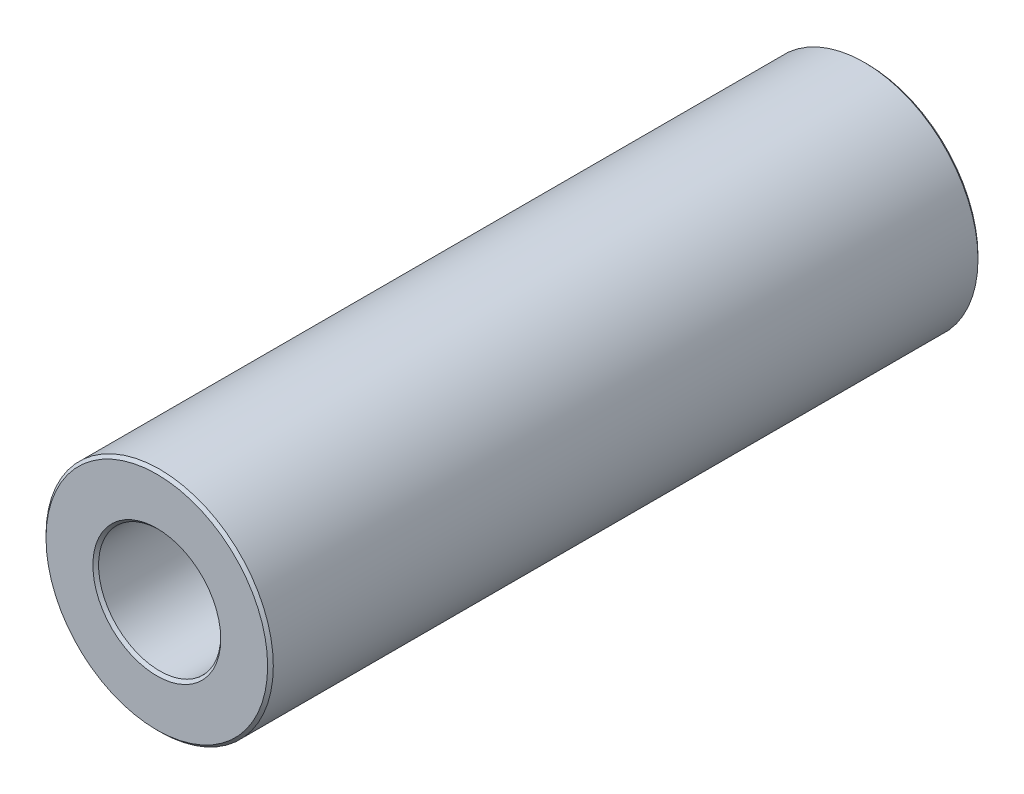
ISO-10303-21;
HEADER;
FILE_DESCRIPTION(('STEP AP214'),'2;1');
FILE_NAME('part.step','',(''),(''),'','','');
FILE_SCHEMA(('AUTOMOTIVE_DESIGN { 1 0 10303 214 1 1 1 1 }'));
ENDSEC;
DATA;
#1=APPLICATION_CONTEXT('core data for automotive mechanical design processes');
#2=APPLICATION_PROTOCOL_DEFINITION('international standard','automotive_design',2000,#1);
#3=PRODUCT_CONTEXT('',#1,'mechanical');
#4=PRODUCT('Part','Part','',(#3));
#5=PRODUCT_RELATED_PRODUCT_CATEGORY('part','',(#4));
#6=PRODUCT_DEFINITION_FORMATION('','',#4);
#7=PRODUCT_DEFINITION_CONTEXT('part definition',#1,'design');
#8=PRODUCT_DEFINITION('design','',#6,#7);
#9=PRODUCT_DEFINITION_SHAPE('','',#8);
#10=(LENGTH_UNIT() NAMED_UNIT(*) SI_UNIT(.MILLI.,.METRE.));
#11=(NAMED_UNIT(*) PLANE_ANGLE_UNIT() SI_UNIT($,.RADIAN.));
#12=(NAMED_UNIT(*) SI_UNIT($,.STERADIAN.) SOLID_ANGLE_UNIT());
#13=UNCERTAINTY_MEASURE_WITH_UNIT(LENGTH_MEASURE(1.E-05),#10,'distance_accuracy_value','');
#14=(GEOMETRIC_REPRESENTATION_CONTEXT(3) GLOBAL_UNCERTAINTY_ASSIGNED_CONTEXT((#13)) GLOBAL_UNIT_ASSIGNED_CONTEXT((#10,
#11,#12)) REPRESENTATION_CONTEXT('',''));
#15=CARTESIAN_POINT('',(0.,0.,0.));
#16=DIRECTION('',(0.,0.,1.));
#17=DIRECTION('',(1.,0.,0.));
#18=AXIS2_PLACEMENT_3D('',#15,#16,#17);
#19=CARTESIAN_POINT('',(0.,0.,12.5));
#20=DIRECTION('',(0.,0.,1.));
#21=DIRECTION('',(1.,0.,0.));
#22=AXIS2_PLACEMENT_3D('',#19,#20,#21);
#23=PLANE('',#22);
#24=CARTESIAN_POINT('',(0.,0.,12.5));
#25=DIRECTION('',(0.,0.,1.));
#26=DIRECTION('',(1.,0.,0.));
#27=AXIS2_PLACEMENT_3D('',#24,#25,#26);
#28=CIRCLE('',#27,2.24999999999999);
#29=CARTESIAN_POINT('',(2.24999999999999,0.,12.5));
#30=VERTEX_POINT('',#29);
#31=EDGE_CURVE('E10',#30,#30,#28,.F.);
#32=ORIENTED_EDGE('',*,*,#31,.T.);
#33=EDGE_LOOP('',(#32));
#34=FACE_BOUND('',#33,.T.);
#35=CARTESIAN_POINT('',(0.,0.,12.5));
#36=DIRECTION('',(0.,0.,1.));
#37=DIRECTION('',(1.,0.,0.));
#38=AXIS2_PLACEMENT_3D('',#35,#36,#37);
#39=CIRCLE('',#38,3.89999999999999);
#40=CARTESIAN_POINT('',(3.89999999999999,0.,12.5));
#41=VERTEX_POINT('',#40);
#42=EDGE_CURVE('E45',#41,#41,#39,.T.);
#43=ORIENTED_EDGE('',*,*,#42,.T.);
#44=EDGE_LOOP('',(#43));
#45=FACE_BOUND('',#44,.T.);
#46=ADVANCED_FACE('F37',(#34,#45),#23,.T.);
#47=CARTESIAN_POINT('',(0.,0.,-12.5));
#48=DIRECTION('',(0.,0.,1.));
#49=DIRECTION('',(1.,0.,0.));
#50=AXIS2_PLACEMENT_3D('',#47,#48,#49);
#51=PLANE('',#50);
#52=CARTESIAN_POINT('',(0.,0.,-12.5));
#53=DIRECTION('',(0.,0.,1.));
#54=DIRECTION('',(1.,0.,0.));
#55=AXIS2_PLACEMENT_3D('',#52,#53,#54);
#56=CIRCLE('',#55,3.9);
#57=CARTESIAN_POINT('',(3.9,0.,-12.5));
#58=VERTEX_POINT('',#57);
#59=EDGE_CURVE('E64',#58,#58,#56,.F.);
#60=ORIENTED_EDGE('',*,*,#59,.T.);
#61=EDGE_LOOP('',(#60));
#62=FACE_BOUND('',#61,.T.);
#63=CARTESIAN_POINT('',(0.,0.,-12.5));
#64=DIRECTION('',(0.,0.,1.));
#65=DIRECTION('',(1.,0.,0.));
#66=AXIS2_PLACEMENT_3D('',#63,#64,#65);
#67=CIRCLE('',#66,2.25);
#68=CARTESIAN_POINT('',(2.25,0.,-12.5));
#69=VERTEX_POINT('',#68);
#70=EDGE_CURVE('E68',#69,#69,#67,.T.);
#71=ORIENTED_EDGE('',*,*,#70,.T.);
#72=EDGE_LOOP('',(#71));
#73=FACE_BOUND('',#72,.T.);
#74=ADVANCED_FACE('F89',(#62,#73),#51,.F.);
#75=CARTESIAN_POINT('',(0.,0.,12.5));
#76=DIRECTION('',(0.,0.,-1.));
#77=DIRECTION('',(-1.,0.,0.));
#78=AXIS2_PLACEMENT_3D('',#75,#76,#77);
#79=CYLINDRICAL_SURFACE('',#78,4.);
#80=CARTESIAN_POINT('',(0.,0.,-12.4));
#81=DIRECTION('',(0.,0.,1.));
#82=DIRECTION('',(1.,0.,0.));
#83=AXIS2_PLACEMENT_3D('',#80,#81,#82);
#84=CIRCLE('',#83,4.);
#85=CARTESIAN_POINT('',(4.,0.,-12.4));
#86=VERTEX_POINT('',#85);
#87=EDGE_CURVE('E71',#86,#86,#84,.T.);
#88=ORIENTED_EDGE('',*,*,#87,.T.);
#89=EDGE_LOOP('',(#88));
#90=FACE_BOUND('',#89,.T.);
#91=CARTESIAN_POINT('',(0.,0.,12.4));
#92=DIRECTION('',(0.,0.,1.));
#93=DIRECTION('',(1.,0.,0.));
#94=AXIS2_PLACEMENT_3D('',#91,#92,#93);
#95=CIRCLE('',#94,4.);
#96=CARTESIAN_POINT('',(4.,0.,12.4));
#97=VERTEX_POINT('',#96);
#98=EDGE_CURVE('E74',#97,#97,#95,.F.);
#99=ORIENTED_EDGE('',*,*,#98,.T.);
#100=EDGE_LOOP('',(#99));
#101=FACE_BOUND('',#100,.T.);
#102=ADVANCED_FACE('F78',(#90,#101),#79,.T.);
#103=CARTESIAN_POINT('',(0.,0.,12.5));
#104=DIRECTION('',(0.,0.,-1.));
#105=DIRECTION('',(-1.,0.,0.));
#106=AXIS2_PLACEMENT_3D('',#103,#104,#105);
#107=CYLINDRICAL_SURFACE('',#106,2.15);
#108=CARTESIAN_POINT('',(0.,0.,-12.4));
#109=DIRECTION('',(0.,0.,1.));
#110=DIRECTION('',(1.,0.,0.));
#111=AXIS2_PLACEMENT_3D('',#108,#109,#110);
#112=CIRCLE('',#111,2.15);
#113=CARTESIAN_POINT('',(2.15,0.,-12.4));
#114=VERTEX_POINT('',#113);
#115=EDGE_CURVE('E52',#114,#114,#112,.F.);
#116=ORIENTED_EDGE('',*,*,#115,.T.);
#117=EDGE_LOOP('',(#116));
#118=FACE_BOUND('',#117,.T.);
#119=CARTESIAN_POINT('',(0.,0.,12.4));
#120=DIRECTION('',(0.,0.,1.));
#121=DIRECTION('',(1.,0.,0.));
#122=AXIS2_PLACEMENT_3D('',#119,#120,#121);
#123=CIRCLE('',#122,2.15);
#124=CARTESIAN_POINT('',(2.15,0.,12.4));
#125=VERTEX_POINT('',#124);
#126=EDGE_CURVE('E58',#125,#125,#123,.T.);
#127=ORIENTED_EDGE('',*,*,#126,.T.);
#128=EDGE_LOOP('',(#127));
#129=FACE_BOUND('',#128,.T.);
#130=ADVANCED_FACE('F97',(#118,#129),#107,.F.);
#131=CARTESIAN_POINT('',(0.,0.,-12.4));
#132=DIRECTION('',(0.,0.,1.));
#133=DIRECTION('',(1.,0.,0.));
#134=AXIS2_PLACEMENT_3D('',#131,#132,#133);
#135=CONICAL_SURFACE('',#134,4.,0.785398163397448);
#136=ORIENTED_EDGE('',*,*,#59,.F.);
#137=EDGE_LOOP('',(#136));
#138=FACE_BOUND('',#137,.T.);
#139=ORIENTED_EDGE('',*,*,#87,.F.);
#140=EDGE_LOOP('',(#139));
#141=FACE_BOUND('',#140,.T.);
#142=ADVANCED_FACE('F102',(#138,#141),#135,.T.);
#143=CARTESIAN_POINT('',(0.,0.,-12.5));
#144=DIRECTION('',(0.,0.,-1.));
#145=DIRECTION('',(-1.,0.,0.));
#146=AXIS2_PLACEMENT_3D('',#143,#144,#145);
#147=CONICAL_SURFACE('',#146,2.25,0.785398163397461);
#148=ORIENTED_EDGE('',*,*,#115,.F.);
#149=EDGE_LOOP('',(#148));
#150=FACE_BOUND('',#149,.T.);
#151=ORIENTED_EDGE('',*,*,#70,.F.);
#152=EDGE_LOOP('',(#151));
#153=FACE_BOUND('',#152,.T.);
#154=ADVANCED_FACE('F86',(#150,#153),#147,.F.);
#155=CARTESIAN_POINT('',(0.,0.,12.4));
#156=DIRECTION('',(0.,0.,1.));
#157=DIRECTION('',(1.,0.,0.));
#158=AXIS2_PLACEMENT_3D('',#155,#156,#157);
#159=CONICAL_SURFACE('',#158,2.15,0.785398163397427);
#160=ORIENTED_EDGE('',*,*,#31,.F.);
#161=EDGE_LOOP('',(#160));
#162=FACE_BOUND('',#161,.T.);
#163=ORIENTED_EDGE('',*,*,#126,.F.);
#164=EDGE_LOOP('',(#163));
#165=FACE_BOUND('',#164,.T.);
#166=ADVANCED_FACE('F82',(#162,#165),#159,.F.);
#167=CARTESIAN_POINT('',(0.,0.,12.5));
#168=DIRECTION('',(0.,0.,-1.));
#169=DIRECTION('',(-1.,0.,0.));
#170=AXIS2_PLACEMENT_3D('',#167,#168,#169);
#171=CONICAL_SURFACE('',#170,3.89999999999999,0.785398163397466);
#172=ORIENTED_EDGE('',*,*,#98,.F.);
#173=EDGE_LOOP('',(#172));
#174=FACE_BOUND('',#173,.T.);
#175=ORIENTED_EDGE('',*,*,#42,.F.);
#176=EDGE_LOOP('',(#175));
#177=FACE_BOUND('',#176,.T.);
#178=ADVANCED_FACE('F39',(#174,#177),#171,.T.);
#179=CLOSED_SHELL('',(#46,#74,#102,#130,#142,#154,#166,#178));
#180=MANIFOLD_SOLID_BREP('B2',#179);
#181=ADVANCED_BREP_SHAPE_REPRESENTATION('',(#18,#180),#14);
#182=SHAPE_DEFINITION_REPRESENTATION(#9,#181);
ENDSEC;
END-ISO-10303-21;
